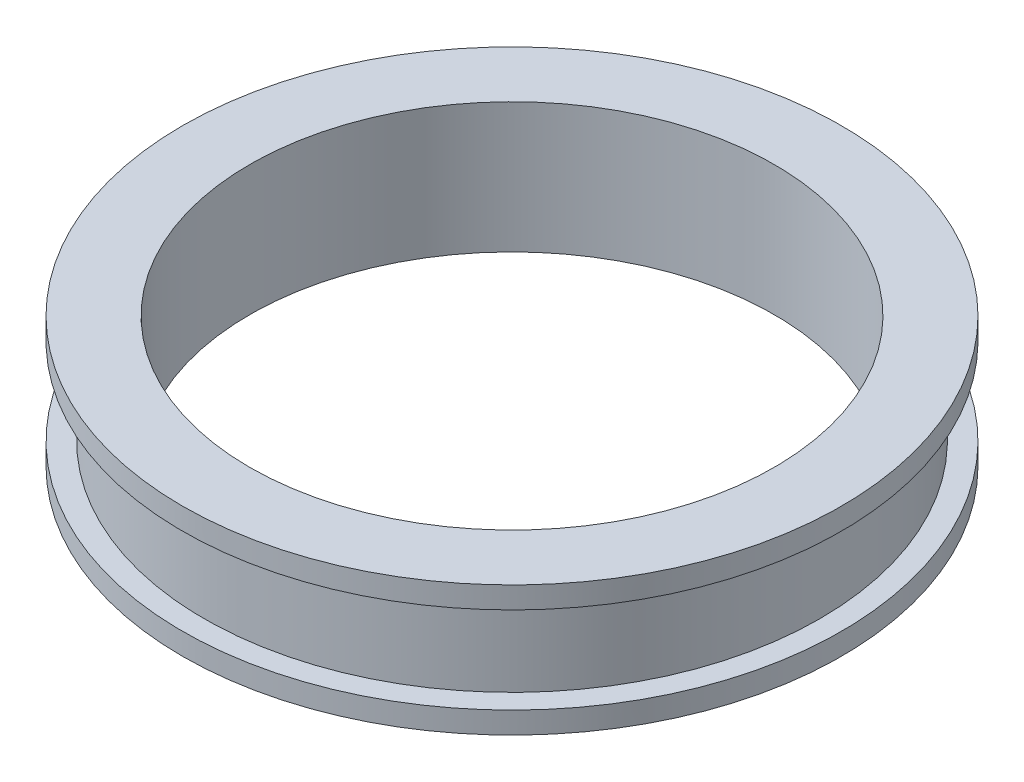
ISO-10303-21;
HEADER;
FILE_DESCRIPTION(('STEP AP214'),'2;1');
FILE_NAME('part.step','',(''),(''),'','','');
FILE_SCHEMA(('AUTOMOTIVE_DESIGN { 1 0 10303 214 1 1 1 1 }'));
ENDSEC;
DATA;
#1=APPLICATION_CONTEXT('core data for automotive mechanical design processes');
#2=APPLICATION_PROTOCOL_DEFINITION('international standard','automotive_design',2000,#1);
#3=PRODUCT_CONTEXT('',#1,'mechanical');
#4=PRODUCT('Part','Part','',(#3));
#5=PRODUCT_RELATED_PRODUCT_CATEGORY('part','',(#4));
#6=PRODUCT_DEFINITION_FORMATION('','',#4);
#7=PRODUCT_DEFINITION_CONTEXT('part definition',#1,'design');
#8=PRODUCT_DEFINITION('design','',#6,#7);
#9=PRODUCT_DEFINITION_SHAPE('','',#8);
#10=(LENGTH_UNIT() NAMED_UNIT(*) SI_UNIT(.MILLI.,.METRE.));
#11=(NAMED_UNIT(*) PLANE_ANGLE_UNIT() SI_UNIT($,.RADIAN.));
#12=(NAMED_UNIT(*) SI_UNIT($,.STERADIAN.) SOLID_ANGLE_UNIT());
#13=UNCERTAINTY_MEASURE_WITH_UNIT(LENGTH_MEASURE(1.E-05),#10,'distance_accuracy_value','');
#14=(GEOMETRIC_REPRESENTATION_CONTEXT(3) GLOBAL_UNCERTAINTY_ASSIGNED_CONTEXT((#13)) GLOBAL_UNIT_ASSIGNED_CONTEXT((#10,
#11,#12)) REPRESENTATION_CONTEXT('',''));
#15=CARTESIAN_POINT('',(0.,0.,0.));
#16=DIRECTION('',(0.,0.,1.));
#17=DIRECTION('',(1.,0.,0.));
#18=AXIS2_PLACEMENT_3D('',#15,#16,#17);
#19=CARTESIAN_POINT('',(0.,30.,0.));
#20=DIRECTION('',(0.,-1.,0.));
#21=DIRECTION('',(0.,0.,-1.));
#22=AXIS2_PLACEMENT_3D('',#19,#20,#21);
#23=CYLINDRICAL_SURFACE('',#22,76.);
#24=CARTESIAN_POINT('',(0.,5.00000000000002,0.));
#25=DIRECTION('',(0.,1.,0.));
#26=DIRECTION('',(-1.,0.,0.));
#27=AXIS2_PLACEMENT_3D('',#24,#25,#26);
#28=CIRCLE('',#27,76.);
#29=CARTESIAN_POINT('',(-76.,5.00000000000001,0.));
#30=VERTEX_POINT('',#29);
#31=EDGE_CURVE('E56',#30,#30,#28,.T.);
#32=ORIENTED_EDGE('',*,*,#31,.F.);
#33=EDGE_LOOP('',(#32));
#34=FACE_BOUND('',#33,.T.);
#35=CARTESIAN_POINT('',(0.,0.,0.));
#36=DIRECTION('',(0.,1.,0.));
#37=DIRECTION('',(0.,0.,1.));
#38=AXIS2_PLACEMENT_3D('',#35,#36,#37);
#39=CIRCLE('',#38,76.);
#40=CARTESIAN_POINT('',(0.,0.,76.));
#41=VERTEX_POINT('',#40);
#42=EDGE_CURVE('E50',#41,#41,#39,.T.);
#43=ORIENTED_EDGE('',*,*,#42,.T.);
#44=EDGE_LOOP('',(#43));
#45=FACE_BOUND('',#44,.T.);
#46=ADVANCED_FACE('F43',(#34,#45),#23,.T.);
#47=CARTESIAN_POINT('',(0.,25.,0.));
#48=DIRECTION('',(0.,1.,0.));
#49=DIRECTION('',(-1.,0.,0.));
#50=AXIS2_PLACEMENT_3D('',#47,#48,#49);
#51=CIRCLE('',#50,76.);
#52=CARTESIAN_POINT('',(-76.,25.,0.));
#53=VERTEX_POINT('',#52);
#54=EDGE_CURVE('E68',#53,#53,#51,.T.);
#55=ORIENTED_EDGE('',*,*,#54,.T.);
#56=EDGE_LOOP('',(#55));
#57=FACE_BOUND('',#56,.T.);
#58=CARTESIAN_POINT('',(0.,30.,0.));
#59=DIRECTION('',(0.,1.,0.));
#60=DIRECTION('',(0.,0.,1.));
#61=AXIS2_PLACEMENT_3D('',#58,#59,#60);
#62=CIRCLE('',#61,76.);
#63=CARTESIAN_POINT('',(0.,30.,76.));
#64=VERTEX_POINT('',#63);
#65=EDGE_CURVE('E10',#64,#64,#62,.T.);
#66=ORIENTED_EDGE('',*,*,#65,.F.);
#67=EDGE_LOOP('',(#66));
#68=FACE_BOUND('',#67,.T.);
#69=ADVANCED_FACE('F44',(#57,#68),#23,.T.);
#70=CARTESIAN_POINT('',(0.,30.,0.));
#71=DIRECTION('',(0.,1.,0.));
#72=DIRECTION('',(0.,0.,1.));
#73=AXIS2_PLACEMENT_3D('',#70,#71,#72);
#74=PLANE('',#73);
#75=CARTESIAN_POINT('',(0.,30.,0.));
#76=DIRECTION('',(0.,1.,0.));
#77=DIRECTION('',(0.,0.,1.));
#78=AXIS2_PLACEMENT_3D('',#75,#76,#77);
#79=CIRCLE('',#78,60.5);
#80=CARTESIAN_POINT('',(0.,30.,60.5));
#81=VERTEX_POINT('',#80);
#82=EDGE_CURVE('E57',#81,#81,#79,.T.);
#83=ORIENTED_EDGE('',*,*,#82,.F.);
#84=EDGE_LOOP('',(#83));
#85=FACE_BOUND('',#84,.T.);
#86=ORIENTED_EDGE('',*,*,#65,.T.);
#87=EDGE_LOOP('',(#86));
#88=FACE_BOUND('',#87,.T.);
#89=ADVANCED_FACE('F101',(#85,#88),#74,.T.);
#90=CARTESIAN_POINT('',(0.,0.,0.));
#91=DIRECTION('',(0.,1.,0.));
#92=DIRECTION('',(0.,0.,1.));
#93=AXIS2_PLACEMENT_3D('',#90,#91,#92);
#94=PLANE('',#93);
#95=CARTESIAN_POINT('',(0.,0.,0.));
#96=DIRECTION('',(0.,1.,0.));
#97=DIRECTION('',(0.,0.,1.));
#98=AXIS2_PLACEMENT_3D('',#95,#96,#97);
#99=CIRCLE('',#98,60.5);
#100=CARTESIAN_POINT('',(0.,0.,60.5));
#101=VERTEX_POINT('',#100);
#102=EDGE_CURVE('E53',#101,#101,#99,.T.);
#103=ORIENTED_EDGE('',*,*,#102,.T.);
#104=EDGE_LOOP('',(#103));
#105=FACE_BOUND('',#104,.T.);
#106=ORIENTED_EDGE('',*,*,#42,.F.);
#107=EDGE_LOOP('',(#106));
#108=FACE_BOUND('',#107,.T.);
#109=ADVANCED_FACE('F97',(#105,#108),#94,.F.);
#110=CARTESIAN_POINT('',(0.,0.,0.));
#111=DIRECTION('',(0.,1.,0.));
#112=DIRECTION('',(0.,0.,1.));
#113=AXIS2_PLACEMENT_3D('',#110,#111,#112);
#114=CYLINDRICAL_SURFACE('',#113,60.5);
#115=ORIENTED_EDGE('',*,*,#102,.F.);
#116=EDGE_LOOP('',(#115));
#117=FACE_BOUND('',#116,.T.);
#118=ORIENTED_EDGE('',*,*,#82,.T.);
#119=EDGE_LOOP('',(#118));
#120=FACE_BOUND('',#119,.T.);
#121=ADVANCED_FACE('F91',(#117,#120),#114,.F.);
#122=CARTESIAN_POINT('',(-76.,5.,0.));
#123=DIRECTION('',(0.,-1.,0.));
#124=DIRECTION('',(1.,0.,0.));
#125=AXIS2_PLACEMENT_3D('',#122,#123,#124);
#126=PLANE('',#125);
#127=CARTESIAN_POINT('',(0.,5.00000000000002,0.));
#128=DIRECTION('',(0.,1.,0.));
#129=DIRECTION('',(-1.,0.,0.));
#130=AXIS2_PLACEMENT_3D('',#127,#128,#129);
#131=CIRCLE('',#130,71.);
#132=CARTESIAN_POINT('',(-71.,5.00000000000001,0.));
#133=VERTEX_POINT('',#132);
#134=EDGE_CURVE('E62',#133,#133,#131,.T.);
#135=ORIENTED_EDGE('',*,*,#134,.F.);
#136=EDGE_LOOP('',(#135));
#137=FACE_BOUND('',#136,.T.);
#138=ORIENTED_EDGE('',*,*,#31,.T.);
#139=EDGE_LOOP('',(#138));
#140=FACE_BOUND('',#139,.T.);
#141=ADVANCED_FACE('F84',(#137,#140),#126,.F.);
#142=CARTESIAN_POINT('',(0.,69.9613598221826,0.));
#143=DIRECTION('',(0.,1.,0.));
#144=DIRECTION('',(-1.,0.,0.));
#145=AXIS2_PLACEMENT_3D('',#142,#143,#144);
#146=CYLINDRICAL_SURFACE('',#145,71.);
#147=CARTESIAN_POINT('',(0.,25.,0.));
#148=DIRECTION('',(0.,1.,0.));
#149=DIRECTION('',(-1.,0.,0.));
#150=AXIS2_PLACEMENT_3D('',#147,#148,#149);
#151=CIRCLE('',#150,71.);
#152=CARTESIAN_POINT('',(-71.,25.,0.));
#153=VERTEX_POINT('',#152);
#154=EDGE_CURVE('E70',#153,#153,#151,.T.);
#155=ORIENTED_EDGE('',*,*,#154,.F.);
#156=EDGE_LOOP('',(#155));
#157=FACE_BOUND('',#156,.T.);
#158=ORIENTED_EDGE('',*,*,#134,.T.);
#159=EDGE_LOOP('',(#158));
#160=FACE_BOUND('',#159,.T.);
#161=ADVANCED_FACE('F79',(#157,#160),#146,.T.);
#162=CARTESIAN_POINT('',(-76.,25.,0.));
#163=DIRECTION('',(0.,1.,0.));
#164=DIRECTION('',(-1.,0.,0.));
#165=AXIS2_PLACEMENT_3D('',#162,#163,#164);
#166=PLANE('',#165);
#167=ORIENTED_EDGE('',*,*,#54,.F.);
#168=EDGE_LOOP('',(#167));
#169=FACE_BOUND('',#168,.T.);
#170=ORIENTED_EDGE('',*,*,#154,.T.);
#171=EDGE_LOOP('',(#170));
#172=FACE_BOUND('',#171,.T.);
#173=ADVANCED_FACE('F77',(#169,#172),#166,.F.);
#174=CLOSED_SHELL('',(#46,#69,#89,#109,#121,#141,#161,#173));
#175=MANIFOLD_SOLID_BREP('B2',#174);
#176=ADVANCED_BREP_SHAPE_REPRESENTATION('',(#18,#175),#14);
#177=SHAPE_DEFINITION_REPRESENTATION(#9,#176);
ENDSEC;
END-ISO-10303-21;
